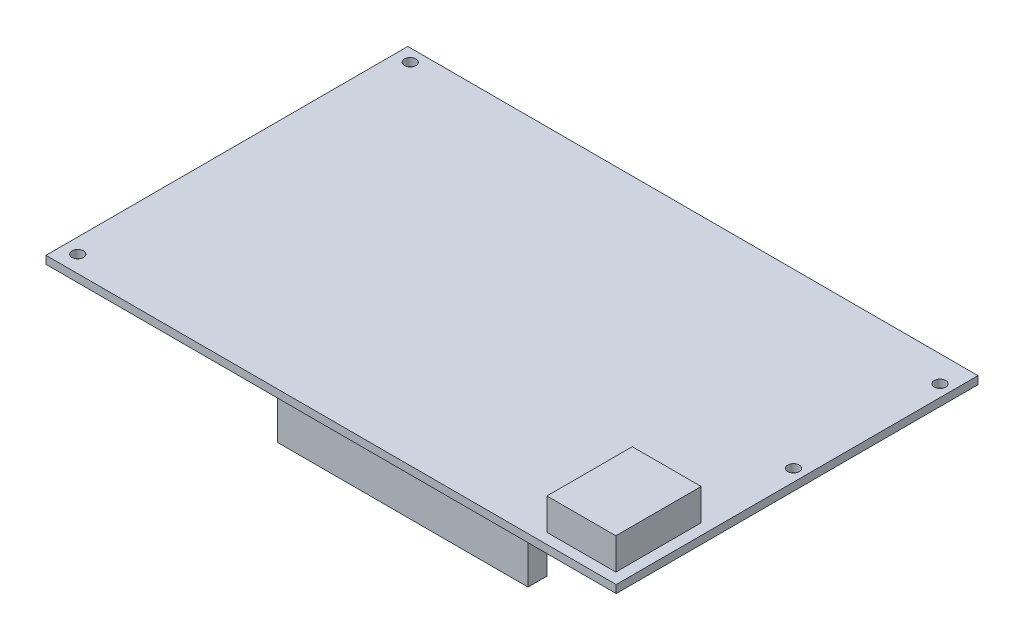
ISO-10303-21;
HEADER;
FILE_DESCRIPTION(('STEP AP214'),'2;1');
FILE_NAME('part.step','',(''),(''),'','','');
FILE_SCHEMA(('AUTOMOTIVE_DESIGN { 1 0 10303 214 1 1 1 1 }'));
ENDSEC;
DATA;
#1=APPLICATION_CONTEXT('core data for automotive mechanical design processes');
#2=APPLICATION_PROTOCOL_DEFINITION('international standard','automotive_design',2000,#1);
#3=PRODUCT_CONTEXT('',#1,'mechanical');
#4=PRODUCT('Part','Part','',(#3));
#5=PRODUCT_RELATED_PRODUCT_CATEGORY('part','',(#4));
#6=PRODUCT_DEFINITION_FORMATION('','',#4);
#7=PRODUCT_DEFINITION_CONTEXT('part definition',#1,'design');
#8=PRODUCT_DEFINITION('design','',#6,#7);
#9=PRODUCT_DEFINITION_SHAPE('','',#8);
#10=(LENGTH_UNIT() NAMED_UNIT(*) SI_UNIT(.MILLI.,.METRE.));
#11=(NAMED_UNIT(*) PLANE_ANGLE_UNIT() SI_UNIT($,.RADIAN.));
#12=(NAMED_UNIT(*) SI_UNIT($,.STERADIAN.) SOLID_ANGLE_UNIT());
#13=UNCERTAINTY_MEASURE_WITH_UNIT(LENGTH_MEASURE(1.E-05),#10,'distance_accuracy_value','');
#14=(GEOMETRIC_REPRESENTATION_CONTEXT(3) GLOBAL_UNCERTAINTY_ASSIGNED_CONTEXT((#13)) GLOBAL_UNIT_ASSIGNED_CONTEXT((#10,
#11,#12)) REPRESENTATION_CONTEXT('',''));
#15=CARTESIAN_POINT('',(0.,0.,0.));
#16=DIRECTION('',(0.,0.,1.));
#17=DIRECTION('',(1.,0.,0.));
#18=AXIS2_PLACEMENT_3D('',#15,#16,#17);
#19=CARTESIAN_POINT('',(0.,0.,-92.5957));
#20=DIRECTION('',(0.,-1.,0.));
#21=DIRECTION('',(0.,0.,-1.));
#22=AXIS2_PLACEMENT_3D('',#19,#20,#21);
#23=PLANE('',#22);
#24=CARTESIAN_POINT('',(142.875,0.,-48.4505));
#25=DIRECTION('',(0.,1.,0.));
#26=DIRECTION('',(0.,0.,1.));
#27=AXIS2_PLACEMENT_3D('',#24,#25,#26);
#28=CIRCLE('',#27,1.4732);
#29=CARTESIAN_POINT('',(142.875,0.,-46.9773));
#30=VERTEX_POINT('',#29);
#31=EDGE_CURVE('E191',#30,#30,#28,.T.);
#32=ORIENTED_EDGE('',*,*,#31,.T.);
#33=EDGE_LOOP('',(#32));
#34=FACE_BOUND('',#33,.T.);
#35=CARTESIAN_POINT('',(3.81,0.,-4.318));
#36=DIRECTION('',(0.,1.,0.));
#37=DIRECTION('',(0.,0.,1.));
#38=AXIS2_PLACEMENT_3D('',#35,#36,#37);
#39=CIRCLE('',#38,1.4732);
#40=CARTESIAN_POINT('',(3.81,0.,-2.8448));
#41=VERTEX_POINT('',#40);
#42=EDGE_CURVE('E203',#41,#41,#39,.T.);
#43=ORIENTED_EDGE('',*,*,#42,.T.);
#44=EDGE_LOOP('',(#43));
#45=FACE_BOUND('',#44,.T.);
#46=DIRECTION('',(0.,0.,1.));
#47=VECTOR('',#46,1.);
#48=CARTESIAN_POINT('',(0.,0.,0.));
#49=LINE('',#48,#47);
#50=CARTESIAN_POINT('',(0.,0.,-92.5957));
#51=VERTEX_POINT('',#50);
#52=CARTESIAN_POINT('',(0.,0.,0.));
#53=VERTEX_POINT('',#52);
#54=EDGE_CURVE('E215',#51,#53,#49,.T.);
#55=ORIENTED_EDGE('',*,*,#54,.F.);
#56=DIRECTION('',(-1.,0.,0.));
#57=VECTOR('',#56,1.);
#58=CARTESIAN_POINT('',(0.,0.,-92.5957));
#59=LINE('',#58,#57);
#60=CARTESIAN_POINT('',(145.9357,0.,-92.5957));
#61=VERTEX_POINT('',#60);
#62=EDGE_CURVE('E222',#61,#51,#59,.T.);
#63=ORIENTED_EDGE('',*,*,#62,.F.);
#64=DIRECTION('',(0.,0.,-1.));
#65=VECTOR('',#64,1.);
#66=CARTESIAN_POINT('',(145.9357,0.,0.));
#67=LINE('',#66,#65);
#68=CARTESIAN_POINT('',(145.9357,0.,0.));
#69=VERTEX_POINT('',#68);
#70=EDGE_CURVE('E220',#69,#61,#67,.T.);
#71=ORIENTED_EDGE('',*,*,#70,.F.);
#72=DIRECTION('',(1.,0.,0.));
#73=VECTOR('',#72,1.);
#74=CARTESIAN_POINT('',(0.,0.,0.));
#75=LINE('',#74,#73);
#76=EDGE_CURVE('E218',#53,#69,#75,.T.);
#77=ORIENTED_EDGE('',*,*,#76,.F.);
#78=EDGE_LOOP('',(#55,#63,#71,#77));
#79=FACE_BOUND('',#78,.T.);
#80=CARTESIAN_POINT('',(3.81,0.,-89.408));
#81=DIRECTION('',(0.,1.,0.));
#82=DIRECTION('',(0.,0.,1.));
#83=AXIS2_PLACEMENT_3D('',#80,#81,#82);
#84=CIRCLE('',#83,1.4732);
#85=CARTESIAN_POINT('',(3.81,0.,-87.9348));
#86=VERTEX_POINT('',#85);
#87=EDGE_CURVE('E209',#86,#86,#84,.T.);
#88=ORIENTED_EDGE('',*,*,#87,.T.);
#89=EDGE_LOOP('',(#88));
#90=FACE_BOUND('',#89,.T.);
#91=CARTESIAN_POINT('',(142.875,0.,-85.9155));
#92=DIRECTION('',(0.,1.,0.));
#93=DIRECTION('',(0.,0.,1.));
#94=AXIS2_PLACEMENT_3D('',#91,#92,#93);
#95=CIRCLE('',#94,1.4732);
#96=CARTESIAN_POINT('',(142.875,0.,-84.4423));
#97=VERTEX_POINT('',#96);
#98=EDGE_CURVE('E197',#97,#97,#95,.T.);
#99=ORIENTED_EDGE('',*,*,#98,.T.);
#100=EDGE_LOOP('',(#99));
#101=FACE_BOUND('',#100,.T.);
#102=DIRECTION('',(1.,0.,0.));
#103=VECTOR('',#102,1.);
#104=CARTESIAN_POINT('',(57.8866,0.,-6.2357));
#105=LINE('',#104,#103);
#106=CARTESIAN_POINT('',(57.8866,0.,-6.2357));
#107=VERTEX_POINT('',#106);
#108=CARTESIAN_POINT('',(121.9708,0.,-6.2357));
#109=VERTEX_POINT('',#108);
#110=EDGE_CURVE('E127',#107,#109,#105,.T.);
#111=ORIENTED_EDGE('',*,*,#110,.F.);
#112=DIRECTION('',(0.,0.,-1.));
#113=VECTOR('',#112,1.);
#114=CARTESIAN_POINT('',(57.8866,0.,-1.397));
#115=LINE('',#114,#113);
#116=CARTESIAN_POINT('',(57.8866,0.,-1.397));
#117=VERTEX_POINT('',#116);
#118=EDGE_CURVE('E138',#117,#107,#115,.T.);
#119=ORIENTED_EDGE('',*,*,#118,.F.);
#120=DIRECTION('',(-1.,0.,0.));
#121=VECTOR('',#120,1.);
#122=CARTESIAN_POINT('',(57.8866,0.,-1.397));
#123=LINE('',#122,#121);
#124=CARTESIAN_POINT('',(121.9708,0.,-1.397));
#125=VERTEX_POINT('',#124);
#126=EDGE_CURVE('E148',#125,#117,#123,.T.);
#127=ORIENTED_EDGE('',*,*,#126,.F.);
#128=DIRECTION('',(0.,0.,1.));
#129=VECTOR('',#128,1.);
#130=CARTESIAN_POINT('',(121.9708,0.,-1.397));
#131=LINE('',#130,#129);
#132=EDGE_CURVE('E146',#109,#125,#131,.T.);
#133=ORIENTED_EDGE('',*,*,#132,.F.);
#134=EDGE_LOOP('',(#111,#119,#127,#133));
#135=FACE_BOUND('',#134,.T.);
#136=ADVANCED_FACE('F33',(#34,#45,#79,#90,#101,#135),#23,.T.);
#137=CARTESIAN_POINT('',(0.,2.0066,-92.5957));
#138=DIRECTION('',(0.,-1.,0.));
#139=DIRECTION('',(0.,0.,-1.));
#140=AXIS2_PLACEMENT_3D('',#137,#138,#139);
#141=PLANE('',#140);
#142=CARTESIAN_POINT('',(142.875,2.0066,-48.4505));
#143=DIRECTION('',(0.,1.,0.));
#144=DIRECTION('',(0.,0.,1.));
#145=AXIS2_PLACEMENT_3D('',#142,#143,#144);
#146=CIRCLE('',#145,1.4732);
#147=CARTESIAN_POINT('',(142.875,2.0066,-46.9773));
#148=VERTEX_POINT('',#147);
#149=EDGE_CURVE('E194',#148,#148,#146,.T.);
#150=ORIENTED_EDGE('',*,*,#149,.F.);
#151=EDGE_LOOP('',(#150));
#152=FACE_BOUND('',#151,.T.);
#153=CARTESIAN_POINT('',(3.81,2.0066,-4.318));
#154=DIRECTION('',(0.,1.,0.));
#155=DIRECTION('',(0.,0.,1.));
#156=AXIS2_PLACEMENT_3D('',#153,#154,#155);
#157=CIRCLE('',#156,1.4732);
#158=CARTESIAN_POINT('',(3.81,2.0066,-2.8448));
#159=VERTEX_POINT('',#158);
#160=EDGE_CURVE('E206',#159,#159,#157,.T.);
#161=ORIENTED_EDGE('',*,*,#160,.F.);
#162=EDGE_LOOP('',(#161));
#163=FACE_BOUND('',#162,.T.);
#164=DIRECTION('',(0.,0.,1.));
#165=VECTOR('',#164,1.);
#166=CARTESIAN_POINT('',(0.,2.0066,0.));
#167=LINE('',#166,#165);
#168=CARTESIAN_POINT('',(0.,2.0066,-92.5957));
#169=VERTEX_POINT('',#168);
#170=CARTESIAN_POINT('',(0.,2.0066,0.));
#171=VERTEX_POINT('',#170);
#172=EDGE_CURVE('E224',#169,#171,#167,.T.);
#173=ORIENTED_EDGE('',*,*,#172,.T.);
#174=DIRECTION('',(1.,0.,0.));
#175=VECTOR('',#174,1.);
#176=CARTESIAN_POINT('',(0.,2.0066,0.));
#177=LINE('',#176,#175);
#178=CARTESIAN_POINT('',(145.9357,2.0066,0.));
#179=VERTEX_POINT('',#178);
#180=EDGE_CURVE('E227',#171,#179,#177,.T.);
#181=ORIENTED_EDGE('',*,*,#180,.T.);
#182=DIRECTION('',(0.,0.,-1.));
#183=VECTOR('',#182,1.);
#184=CARTESIAN_POINT('',(145.9357,2.0066,0.));
#185=LINE('',#184,#183);
#186=CARTESIAN_POINT('',(145.9357,2.0066,-92.5957));
#187=VERTEX_POINT('',#186);
#188=EDGE_CURVE('E229',#179,#187,#185,.T.);
#189=ORIENTED_EDGE('',*,*,#188,.T.);
#190=DIRECTION('',(-1.,0.,0.));
#191=VECTOR('',#190,1.);
#192=CARTESIAN_POINT('',(0.,2.0066,-92.5957));
#193=LINE('',#192,#191);
#194=EDGE_CURVE('E231',#187,#169,#193,.T.);
#195=ORIENTED_EDGE('',*,*,#194,.T.);
#196=EDGE_LOOP('',(#173,#181,#189,#195));
#197=FACE_BOUND('',#196,.T.);
#198=CARTESIAN_POINT('',(3.81,2.0066,-89.408));
#199=DIRECTION('',(0.,1.,0.));
#200=DIRECTION('',(0.,0.,1.));
#201=AXIS2_PLACEMENT_3D('',#198,#199,#200);
#202=CIRCLE('',#201,1.4732);
#203=CARTESIAN_POINT('',(3.81,2.0066,-87.9348));
#204=VERTEX_POINT('',#203);
#205=EDGE_CURVE('E212',#204,#204,#202,.T.);
#206=ORIENTED_EDGE('',*,*,#205,.F.);
#207=EDGE_LOOP('',(#206));
#208=FACE_BOUND('',#207,.T.);
#209=CARTESIAN_POINT('',(142.875,2.0066,-85.9155));
#210=DIRECTION('',(0.,1.,0.));
#211=DIRECTION('',(0.,0.,1.));
#212=AXIS2_PLACEMENT_3D('',#209,#210,#211);
#213=CIRCLE('',#212,1.4732);
#214=CARTESIAN_POINT('',(142.875,2.0066,-84.4423));
#215=VERTEX_POINT('',#214);
#216=EDGE_CURVE('E200',#215,#215,#213,.T.);
#217=ORIENTED_EDGE('',*,*,#216,.F.);
#218=EDGE_LOOP('',(#217));
#219=FACE_BOUND('',#218,.T.);
#220=DIRECTION('',(0.,0.,1.));
#221=VECTOR('',#220,1.);
#222=CARTESIAN_POINT('',(125.4887,2.0066,-24.5491));
#223=LINE('',#222,#221);
#224=CARTESIAN_POINT('',(125.4887,2.0066,-24.5491));
#225=VERTEX_POINT('',#224);
#226=CARTESIAN_POINT('',(125.4887,2.0066,-2.70510000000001));
#227=VERTEX_POINT('',#226);
#228=EDGE_CURVE('E133',#225,#227,#223,.T.);
#229=ORIENTED_EDGE('',*,*,#228,.F.);
#230=DIRECTION('',(-1.,0.,0.));
#231=VECTOR('',#230,1.);
#232=CARTESIAN_POINT('',(125.4887,2.0066,-24.5491));
#233=LINE('',#232,#231);
#234=CARTESIAN_POINT('',(143.129,2.0066,-24.5491));
#235=VERTEX_POINT('',#234);
#236=EDGE_CURVE('E168',#235,#225,#233,.T.);
#237=ORIENTED_EDGE('',*,*,#236,.F.);
#238=DIRECTION('',(0.,0.,-1.));
#239=VECTOR('',#238,1.);
#240=CARTESIAN_POINT('',(143.129,2.0066,-24.5491));
#241=LINE('',#240,#239);
#242=CARTESIAN_POINT('',(143.129,2.0066,-2.7051));
#243=VERTEX_POINT('',#242);
#244=EDGE_CURVE('E165',#243,#235,#241,.T.);
#245=ORIENTED_EDGE('',*,*,#244,.F.);
#246=DIRECTION('',(1.,0.,0.));
#247=VECTOR('',#246,1.);
#248=CARTESIAN_POINT('',(125.4887,2.0066,-2.7051));
#249=LINE('',#248,#247);
#250=EDGE_CURVE('E56',#227,#243,#249,.T.);
#251=ORIENTED_EDGE('',*,*,#250,.F.);
#252=EDGE_LOOP('',(#229,#237,#245,#251));
#253=FACE_BOUND('',#252,.T.);
#254=ADVANCED_FACE('F258',(#152,#163,#197,#208,#219,#253),#141,.F.);
#255=CARTESIAN_POINT('',(0.,2.0066,0.));
#256=DIRECTION('',(1.,0.,0.));
#257=DIRECTION('',(0.,0.,-1.));
#258=AXIS2_PLACEMENT_3D('',#255,#256,#257);
#259=PLANE('',#258);
#260=ORIENTED_EDGE('',*,*,#54,.T.);
#261=DIRECTION('',(0.,-1.,0.));
#262=VECTOR('',#261,1.);
#263=CARTESIAN_POINT('',(0.,2.0066,0.));
#264=LINE('',#263,#262);
#265=EDGE_CURVE('E11',#171,#53,#264,.T.);
#266=ORIENTED_EDGE('',*,*,#265,.F.);
#267=ORIENTED_EDGE('',*,*,#172,.F.);
#268=DIRECTION('',(0.,-1.,0.));
#269=VECTOR('',#268,1.);
#270=CARTESIAN_POINT('',(0.,2.0066,-92.5957));
#271=LINE('',#270,#269);
#272=EDGE_CURVE('E233',#169,#51,#271,.T.);
#273=ORIENTED_EDGE('',*,*,#272,.T.);
#274=EDGE_LOOP('',(#260,#266,#267,#273));
#275=FACE_BOUND('',#274,.T.);
#276=ADVANCED_FACE('F35',(#275),#259,.F.);
#277=CARTESIAN_POINT('',(0.,2.0066,0.));
#278=DIRECTION('',(0.,0.,-1.));
#279=DIRECTION('',(-1.,0.,0.));
#280=AXIS2_PLACEMENT_3D('',#277,#278,#279);
#281=PLANE('',#280);
#282=ORIENTED_EDGE('',*,*,#76,.T.);
#283=DIRECTION('',(0.,-1.,0.));
#284=VECTOR('',#283,1.);
#285=CARTESIAN_POINT('',(145.9357,2.0066,0.));
#286=LINE('',#285,#284);
#287=EDGE_CURVE('E41',#179,#69,#286,.T.);
#288=ORIENTED_EDGE('',*,*,#287,.F.);
#289=ORIENTED_EDGE('',*,*,#180,.F.);
#290=ORIENTED_EDGE('',*,*,#265,.T.);
#291=EDGE_LOOP('',(#282,#288,#289,#290));
#292=FACE_BOUND('',#291,.T.);
#293=ADVANCED_FACE('F260',(#292),#281,.F.);
#294=CARTESIAN_POINT('',(145.9357,2.0066,0.));
#295=DIRECTION('',(-1.,0.,0.));
#296=DIRECTION('',(0.,0.,1.));
#297=AXIS2_PLACEMENT_3D('',#294,#295,#296);
#298=PLANE('',#297);
#299=ORIENTED_EDGE('',*,*,#70,.T.);
#300=DIRECTION('',(0.,-1.,0.));
#301=VECTOR('',#300,1.);
#302=CARTESIAN_POINT('',(145.9357,2.0066,-92.5957));
#303=LINE('',#302,#301);
#304=EDGE_CURVE('E236',#187,#61,#303,.T.);
#305=ORIENTED_EDGE('',*,*,#304,.F.);
#306=ORIENTED_EDGE('',*,*,#188,.F.);
#307=ORIENTED_EDGE('',*,*,#287,.T.);
#308=EDGE_LOOP('',(#299,#305,#306,#307));
#309=FACE_BOUND('',#308,.T.);
#310=ADVANCED_FACE('F243',(#309),#298,.F.);
#311=CARTESIAN_POINT('',(0.,2.0066,-92.5957));
#312=DIRECTION('',(0.,0.,1.));
#313=DIRECTION('',(1.,0.,0.));
#314=AXIS2_PLACEMENT_3D('',#311,#312,#313);
#315=PLANE('',#314);
#316=ORIENTED_EDGE('',*,*,#62,.T.);
#317=ORIENTED_EDGE('',*,*,#272,.F.);
#318=ORIENTED_EDGE('',*,*,#194,.F.);
#319=ORIENTED_EDGE('',*,*,#304,.T.);
#320=EDGE_LOOP('',(#316,#317,#318,#319));
#321=FACE_BOUND('',#320,.T.);
#322=ADVANCED_FACE('F252',(#321),#315,.F.);
#323=CARTESIAN_POINT('',(3.81,2.0066,-89.408));
#324=DIRECTION('',(0.,-1.,0.));
#325=DIRECTION('',(0.,0.,-1.));
#326=AXIS2_PLACEMENT_3D('',#323,#324,#325);
#327=CYLINDRICAL_SURFACE('',#326,1.4732);
#328=ORIENTED_EDGE('',*,*,#205,.T.);
#329=EDGE_LOOP('',(#328));
#330=FACE_BOUND('',#329,.T.);
#331=ORIENTED_EDGE('',*,*,#87,.F.);
#332=EDGE_LOOP('',(#331));
#333=FACE_BOUND('',#332,.T.);
#334=ADVANCED_FACE('F277',(#330,#333),#327,.F.);
#335=CARTESIAN_POINT('',(3.81,2.0066,-4.318));
#336=DIRECTION('',(0.,-1.,0.));
#337=DIRECTION('',(0.,0.,-1.));
#338=AXIS2_PLACEMENT_3D('',#335,#336,#337);
#339=CYLINDRICAL_SURFACE('',#338,1.4732);
#340=ORIENTED_EDGE('',*,*,#160,.T.);
#341=EDGE_LOOP('',(#340));
#342=FACE_BOUND('',#341,.T.);
#343=ORIENTED_EDGE('',*,*,#42,.F.);
#344=EDGE_LOOP('',(#343));
#345=FACE_BOUND('',#344,.T.);
#346=ADVANCED_FACE('F284',(#342,#345),#339,.F.);
#347=CARTESIAN_POINT('',(142.875,2.0066,-85.9155));
#348=DIRECTION('',(0.,-1.,0.));
#349=DIRECTION('',(0.,0.,-1.));
#350=AXIS2_PLACEMENT_3D('',#347,#348,#349);
#351=CYLINDRICAL_SURFACE('',#350,1.4732);
#352=ORIENTED_EDGE('',*,*,#216,.T.);
#353=EDGE_LOOP('',(#352));
#354=FACE_BOUND('',#353,.T.);
#355=ORIENTED_EDGE('',*,*,#98,.F.);
#356=EDGE_LOOP('',(#355));
#357=FACE_BOUND('',#356,.T.);
#358=ADVANCED_FACE('F289',(#354,#357),#351,.F.);
#359=CARTESIAN_POINT('',(142.875,2.0066,-48.4505));
#360=DIRECTION('',(0.,-1.,0.));
#361=DIRECTION('',(0.,0.,-1.));
#362=AXIS2_PLACEMENT_3D('',#359,#360,#361);
#363=CYLINDRICAL_SURFACE('',#362,1.4732);
#364=ORIENTED_EDGE('',*,*,#149,.T.);
#365=EDGE_LOOP('',(#364));
#366=FACE_BOUND('',#365,.T.);
#367=ORIENTED_EDGE('',*,*,#31,.F.);
#368=EDGE_LOOP('',(#367));
#369=FACE_BOUND('',#368,.T.);
#370=ADVANCED_FACE('F298',(#366,#369),#363,.F.);
#371=CARTESIAN_POINT('',(125.4887,10.0584,-24.5491));
#372=DIRECTION('',(1.,0.,0.));
#373=DIRECTION('',(0.,0.,-1.));
#374=AXIS2_PLACEMENT_3D('',#371,#372,#373);
#375=PLANE('',#374);
#376=ORIENTED_EDGE('',*,*,#228,.T.);
#377=DIRECTION('',(0.,-1.,0.));
#378=VECTOR('',#377,1.);
#379=CARTESIAN_POINT('',(125.4887,10.0584,-2.7051));
#380=LINE('',#379,#378);
#381=CARTESIAN_POINT('',(125.4887,10.0584,-2.7051));
#382=VERTEX_POINT('',#381);
#383=EDGE_CURVE('E189',#382,#227,#380,.T.);
#384=ORIENTED_EDGE('',*,*,#383,.F.);
#385=DIRECTION('',(0.,0.,1.));
#386=VECTOR('',#385,1.);
#387=CARTESIAN_POINT('',(125.4887,10.0584,-24.5491));
#388=LINE('',#387,#386);
#389=CARTESIAN_POINT('',(125.4887,10.0584,-24.5491));
#390=VERTEX_POINT('',#389);
#391=EDGE_CURVE('E171',#390,#382,#388,.T.);
#392=ORIENTED_EDGE('',*,*,#391,.F.);
#393=DIRECTION('',(0.,-1.,0.));
#394=VECTOR('',#393,1.);
#395=CARTESIAN_POINT('',(125.4887,10.0584,-24.5491));
#396=LINE('',#395,#394);
#397=EDGE_CURVE('E180',#390,#225,#396,.T.);
#398=ORIENTED_EDGE('',*,*,#397,.T.);
#399=EDGE_LOOP('',(#376,#384,#392,#398));
#400=FACE_BOUND('',#399,.T.);
#401=ADVANCED_FACE('F304',(#400),#375,.F.);
#402=CARTESIAN_POINT('',(125.4887,10.0584,-2.7051));
#403=DIRECTION('',(0.,0.,-1.));
#404=DIRECTION('',(-1.,0.,0.));
#405=AXIS2_PLACEMENT_3D('',#402,#403,#404);
#406=PLANE('',#405);
#407=ORIENTED_EDGE('',*,*,#250,.T.);
#408=DIRECTION('',(0.,-1.,0.));
#409=VECTOR('',#408,1.);
#410=CARTESIAN_POINT('',(143.129,10.0584,-2.7051));
#411=LINE('',#410,#409);
#412=CARTESIAN_POINT('',(143.129,10.0584,-2.7051));
#413=VERTEX_POINT('',#412);
#414=EDGE_CURVE('E186',#413,#243,#411,.T.);
#415=ORIENTED_EDGE('',*,*,#414,.F.);
#416=DIRECTION('',(1.,0.,0.));
#417=VECTOR('',#416,1.);
#418=CARTESIAN_POINT('',(125.4887,10.0584,-2.7051));
#419=LINE('',#418,#417);
#420=EDGE_CURVE('E174',#382,#413,#419,.T.);
#421=ORIENTED_EDGE('',*,*,#420,.F.);
#422=ORIENTED_EDGE('',*,*,#383,.T.);
#423=EDGE_LOOP('',(#407,#415,#421,#422));
#424=FACE_BOUND('',#423,.T.);
#425=ADVANCED_FACE('F310',(#424),#406,.F.);
#426=CARTESIAN_POINT('',(143.129,10.0584,-24.5491));
#427=DIRECTION('',(-1.,0.,0.));
#428=DIRECTION('',(0.,0.,1.));
#429=AXIS2_PLACEMENT_3D('',#426,#427,#428);
#430=PLANE('',#429);
#431=ORIENTED_EDGE('',*,*,#244,.T.);
#432=DIRECTION('',(0.,-1.,0.));
#433=VECTOR('',#432,1.);
#434=CARTESIAN_POINT('',(143.129,10.0584,-24.5491));
#435=LINE('',#434,#433);
#436=CARTESIAN_POINT('',(143.129,10.0584,-24.5491));
#437=VERTEX_POINT('',#436);
#438=EDGE_CURVE('E183',#437,#235,#435,.T.);
#439=ORIENTED_EDGE('',*,*,#438,.F.);
#440=DIRECTION('',(0.,0.,-1.));
#441=VECTOR('',#440,1.);
#442=CARTESIAN_POINT('',(143.129,10.0584,-24.5491));
#443=LINE('',#442,#441);
#444=EDGE_CURVE('E176',#413,#437,#443,.T.);
#445=ORIENTED_EDGE('',*,*,#444,.F.);
#446=ORIENTED_EDGE('',*,*,#414,.T.);
#447=EDGE_LOOP('',(#431,#439,#445,#446));
#448=FACE_BOUND('',#447,.T.);
#449=ADVANCED_FACE('F314',(#448),#430,.F.);
#450=CARTESIAN_POINT('',(125.4887,10.0584,-24.5491));
#451=DIRECTION('',(0.,0.,1.));
#452=DIRECTION('',(1.,0.,0.));
#453=AXIS2_PLACEMENT_3D('',#450,#451,#452);
#454=PLANE('',#453);
#455=ORIENTED_EDGE('',*,*,#236,.T.);
#456=ORIENTED_EDGE('',*,*,#397,.F.);
#457=DIRECTION('',(-1.,0.,0.));
#458=VECTOR('',#457,1.);
#459=CARTESIAN_POINT('',(125.4887,10.0584,-24.5491));
#460=LINE('',#459,#458);
#461=EDGE_CURVE('E178',#437,#390,#460,.T.);
#462=ORIENTED_EDGE('',*,*,#461,.F.);
#463=ORIENTED_EDGE('',*,*,#438,.T.);
#464=EDGE_LOOP('',(#455,#456,#462,#463));
#465=FACE_BOUND('',#464,.T.);
#466=ADVANCED_FACE('F318',(#465),#454,.F.);
#467=CARTESIAN_POINT('',(125.4887,10.0584,-2.7051));
#468=DIRECTION('',(0.,1.,0.));
#469=DIRECTION('',(0.,0.,1.));
#470=AXIS2_PLACEMENT_3D('',#467,#468,#469);
#471=PLANE('',#470);
#472=ORIENTED_EDGE('',*,*,#391,.T.);
#473=ORIENTED_EDGE('',*,*,#420,.T.);
#474=ORIENTED_EDGE('',*,*,#444,.T.);
#475=ORIENTED_EDGE('',*,*,#461,.T.);
#476=EDGE_LOOP('',(#472,#473,#474,#475));
#477=FACE_BOUND('',#476,.T.);
#478=ADVANCED_FACE('F322',(#477),#471,.T.);
#479=CARTESIAN_POINT('',(57.8866,-11.2395,-1.397));
#480=DIRECTION('',(1.,0.,0.));
#481=DIRECTION('',(0.,0.,-1.));
#482=AXIS2_PLACEMENT_3D('',#479,#480,#481);
#483=PLANE('',#482);
#484=ORIENTED_EDGE('',*,*,#118,.T.);
#485=DIRECTION('',(0.,1.,0.));
#486=VECTOR('',#485,1.);
#487=CARTESIAN_POINT('',(57.8866,-11.2395,-6.2357));
#488=LINE('',#487,#486);
#489=CARTESIAN_POINT('',(57.8866,-11.2395,-6.2357));
#490=VERTEX_POINT('',#489);
#491=EDGE_CURVE('E122',#490,#107,#488,.T.);
#492=ORIENTED_EDGE('',*,*,#491,.F.);
#493=DIRECTION('',(0.,0.,-1.));
#494=VECTOR('',#493,1.);
#495=CARTESIAN_POINT('',(57.8866,-11.2395,-1.397));
#496=LINE('',#495,#494);
#497=CARTESIAN_POINT('',(57.8866,-11.2395,-1.397));
#498=VERTEX_POINT('',#497);
#499=EDGE_CURVE('E152',#498,#490,#496,.T.);
#500=ORIENTED_EDGE('',*,*,#499,.F.);
#501=DIRECTION('',(0.,1.,0.));
#502=VECTOR('',#501,1.);
#503=CARTESIAN_POINT('',(57.8866,-11.2395,-1.397));
#504=LINE('',#503,#502);
#505=EDGE_CURVE('E141',#498,#117,#504,.T.);
#506=ORIENTED_EDGE('',*,*,#505,.T.);
#507=EDGE_LOOP('',(#484,#492,#500,#506));
#508=FACE_BOUND('',#507,.T.);
#509=ADVANCED_FACE('F139',(#508),#483,.F.);
#510=CARTESIAN_POINT('',(57.8866,-11.2395,-6.2357));
#511=DIRECTION('',(0.,0.,1.));
#512=DIRECTION('',(1.,0.,0.));
#513=AXIS2_PLACEMENT_3D('',#510,#511,#512);
#514=PLANE('',#513);
#515=ORIENTED_EDGE('',*,*,#110,.T.);
#516=DIRECTION('',(0.,1.,0.));
#517=VECTOR('',#516,1.);
#518=CARTESIAN_POINT('',(121.9708,-11.2395,-6.2357));
#519=LINE('',#518,#517);
#520=CARTESIAN_POINT('',(121.9708,-11.2395,-6.2357));
#521=VERTEX_POINT('',#520);
#522=EDGE_CURVE('E134',#521,#109,#519,.T.);
#523=ORIENTED_EDGE('',*,*,#522,.F.);
#524=DIRECTION('',(1.,0.,0.));
#525=VECTOR('',#524,1.);
#526=CARTESIAN_POINT('',(57.8866,-11.2395,-6.2357));
#527=LINE('',#526,#525);
#528=EDGE_CURVE('E129',#490,#521,#527,.T.);
#529=ORIENTED_EDGE('',*,*,#528,.F.);
#530=ORIENTED_EDGE('',*,*,#491,.T.);
#531=EDGE_LOOP('',(#515,#523,#529,#530));
#532=FACE_BOUND('',#531,.T.);
#533=ADVANCED_FACE('F124',(#532),#514,.F.);
#534=CARTESIAN_POINT('',(121.9708,-11.2395,-1.397));
#535=DIRECTION('',(-1.,0.,0.));
#536=DIRECTION('',(0.,0.,1.));
#537=AXIS2_PLACEMENT_3D('',#534,#535,#536);
#538=PLANE('',#537);
#539=ORIENTED_EDGE('',*,*,#132,.T.);
#540=DIRECTION('',(0.,1.,0.));
#541=VECTOR('',#540,1.);
#542=CARTESIAN_POINT('',(121.9708,-11.2395,-1.397));
#543=LINE('',#542,#541);
#544=CARTESIAN_POINT('',(121.9708,-11.2395,-1.397));
#545=VERTEX_POINT('',#544);
#546=EDGE_CURVE('E48',#545,#125,#543,.T.);
#547=ORIENTED_EDGE('',*,*,#546,.F.);
#548=DIRECTION('',(0.,0.,1.));
#549=VECTOR('',#548,1.);
#550=CARTESIAN_POINT('',(121.9708,-11.2395,-1.397));
#551=LINE('',#550,#549);
#552=EDGE_CURVE('E155',#521,#545,#551,.T.);
#553=ORIENTED_EDGE('',*,*,#552,.F.);
#554=ORIENTED_EDGE('',*,*,#522,.T.);
#555=EDGE_LOOP('',(#539,#547,#553,#554));
#556=FACE_BOUND('',#555,.T.);
#557=ADVANCED_FACE('F331',(#556),#538,.F.);
#558=CARTESIAN_POINT('',(57.8866,-11.2395,-1.397));
#559=DIRECTION('',(0.,0.,-1.));
#560=DIRECTION('',(-1.,0.,0.));
#561=AXIS2_PLACEMENT_3D('',#558,#559,#560);
#562=PLANE('',#561);
#563=ORIENTED_EDGE('',*,*,#126,.T.);
#564=ORIENTED_EDGE('',*,*,#505,.F.);
#565=DIRECTION('',(-1.,0.,0.));
#566=VECTOR('',#565,1.);
#567=CARTESIAN_POINT('',(57.8866,-11.2395,-1.397));
#568=LINE('',#567,#566);
#569=EDGE_CURVE('E157',#545,#498,#568,.T.);
#570=ORIENTED_EDGE('',*,*,#569,.F.);
#571=ORIENTED_EDGE('',*,*,#546,.T.);
#572=EDGE_LOOP('',(#563,#564,#570,#571));
#573=FACE_BOUND('',#572,.T.);
#574=ADVANCED_FACE('F334',(#573),#562,.F.);
#575=CARTESIAN_POINT('',(57.8866,-11.2395,-6.2357));
#576=DIRECTION('',(0.,-1.,0.));
#577=DIRECTION('',(0.,0.,-1.));
#578=AXIS2_PLACEMENT_3D('',#575,#576,#577);
#579=PLANE('',#578);
#580=ORIENTED_EDGE('',*,*,#499,.T.);
#581=ORIENTED_EDGE('',*,*,#528,.T.);
#582=ORIENTED_EDGE('',*,*,#552,.T.);
#583=ORIENTED_EDGE('',*,*,#569,.T.);
#584=EDGE_LOOP('',(#580,#581,#582,#583));
#585=FACE_BOUND('',#584,.T.);
#586=ADVANCED_FACE('F338',(#585),#579,.T.);
#587=CLOSED_SHELL('',(#136,#254,#276,#293,#310,#322,#334,#346,#358,#370,#401,#425,#449,#466,
#478,#509,#533,#557,#574,#586));
#588=MANIFOLD_SOLID_BREP('B2',#587);
#589=ADVANCED_BREP_SHAPE_REPRESENTATION('',(#18,#588),#14);
#590=SHAPE_DEFINITION_REPRESENTATION(#9,#589);
ENDSEC;
END-ISO-10303-21;
